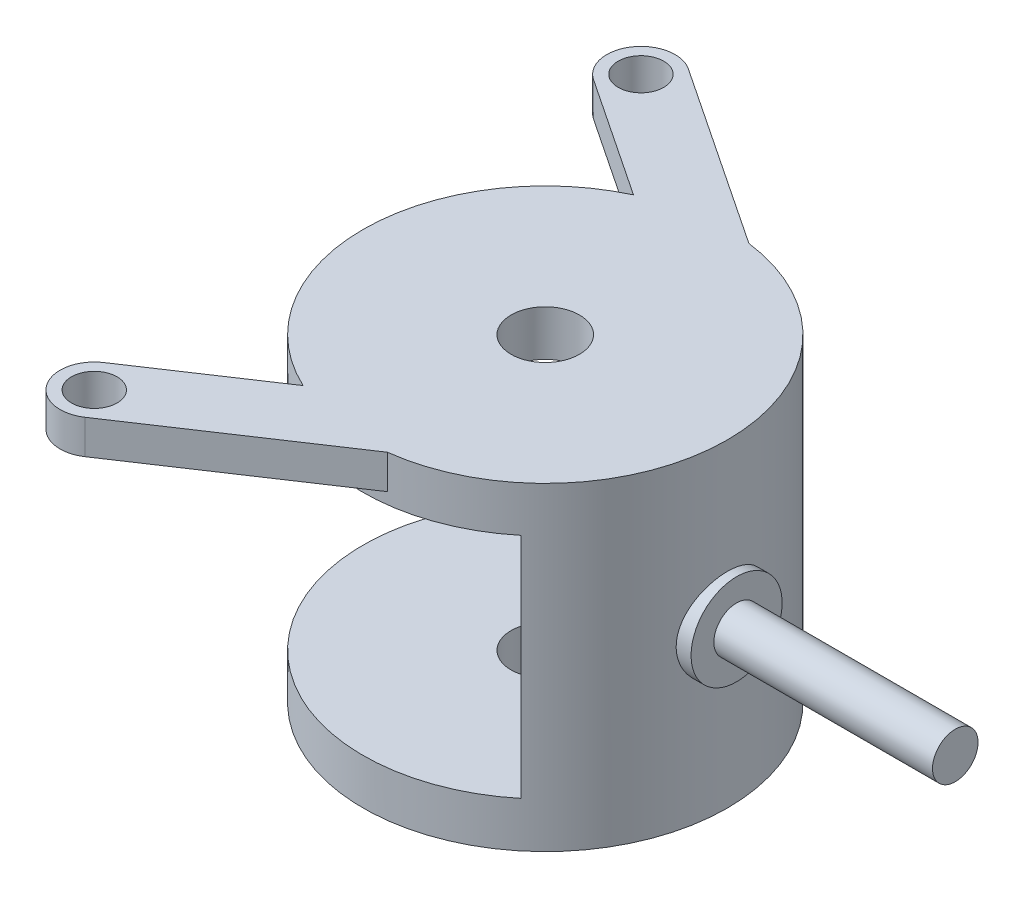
from build123d import *

# Parameters (mm, degrees)
SKIZZE2_W                       = 65
SKIZZE2_H                       = 140
SKIZZE3_W                       = 200
SKIZZE3_H                       = 100
SCHNITT_LINEAR_AUSTRAGEN1_DEPTH = 100
AUFSATZ_LINEAR_START            = -15
SKIZZE6_R                       = 10
AUFSATZ_LINEAR_AUSTRAGEN1_DEPTH = 15


with BuildPart() as part:
    # Skizze2 → Rotation1 (revolve)
    with BuildSketch(Plane.XY.offset(-50)):
        with Locations((577.5, 270)):
            Rectangle(SKIZZE2_W, SKIZZE2_H)
    revolve(axis=Axis((530, -273.519212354, -50), (0, 1, 0)))

    # Skizze3 → Schnitt-Linear austragen1 (cut, symmetric)
    with BuildSketch(Plane.XY.offset(-50)):
        with Locations((481, 270)):
            Rectangle(SKIZZE3_W, SKIZZE3_H)
    extrude(amount=SCHNITT_LINEAR_AUSTRAGEN1_DEPTH, both=True, mode=Mode.SUBTRACT)

    # Skizze4 → Rotation2 (revolve)
    with BuildSketch(Plane.XY.offset(-50), mode=Mode.PRIVATE) as rotation2_sk:
        Polygon((590, 270), (710, 270), (710, 280), (614, 280), (614, 290), (590, 290), align=None)
    revolve(rotation2_sk.sketch.rotate(Axis((610, 270, -50), (1, 0, 0)), 90), axis=Axis((610, 270, -50), (1, 0, 0)))

    # Skizze6 → Aufsatz-Linear austragen1 (add)
    # profile 1 of 2: a face of its own
    with BuildSketch(Plane(origin=(0, 325, 0), x_dir=(-1, 0, 0), z_dir=(0, -1, 0)).offset(AUFSATZ_LINEAR_START)):
        with BuildLine():
            Line((-443.682276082, -57.517393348), (-496.211860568, -22.514561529))
            ThreePointArc((-496.211860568, -22.514561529), (-517.634578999, -29.038575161), (-540.026235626, -29.369229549))
            Line((-540.026235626, -29.369229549), (-460.317723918, -82.482606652))
            ThreePointArc((-460.317723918, -82.482606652), (-439.517393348, -78.317723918), (-443.682276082, -57.517393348))
        make_face()
        with Locations(Location((-452, -70, 0), (0, 0, 90))):
            Circle(SKIZZE6_R, mode=Mode.SUBTRACT)
    # profile 2 of 2: a face of its own
    with BuildSketch(Plane(origin=(0, 325, 0), x_dir=(-1, 0, 0), z_dir=(0, -1, 0)).offset(AUFSATZ_LINEAR_START)):
        with BuildLine():
            Line((-443.682276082, 157.517393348), (-496.211860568, 122.514561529))
            ThreePointArc((-496.211860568, 122.514561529), (-517.634578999, 129.038575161), (-540.026235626, 129.369229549))
            Line((-540.026235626, 129.369229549), (-460.317723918, 182.482606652))
            ThreePointArc((-460.317723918, 182.482606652), (-439.517393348, 178.317723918), (-443.682276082, 157.517393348))
        make_face()
        with Locations((-452, 170)):
            Circle(SKIZZE6_R, mode=Mode.SUBTRACT)
    extrude(amount=AUFSATZ_LINEAR_AUSTRAGEN1_DEPTH)


solid = part.part
